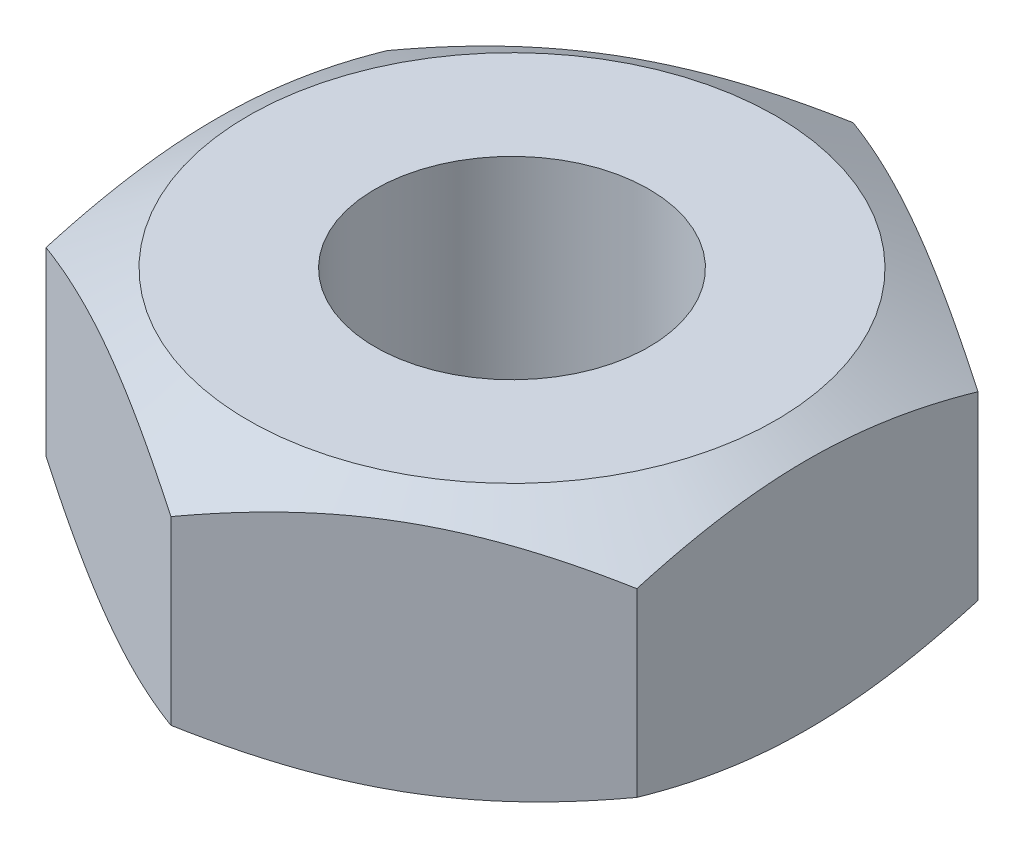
ISO-10303-21;
HEADER;
FILE_DESCRIPTION(('STEP AP214'),'2;1');
FILE_NAME('part.step','',(''),(''),'','','');
FILE_SCHEMA(('AUTOMOTIVE_DESIGN { 1 0 10303 214 1 1 1 1 }'));
ENDSEC;
DATA;
#1=APPLICATION_CONTEXT('core data for automotive mechanical design processes');
#2=APPLICATION_PROTOCOL_DEFINITION('international standard','automotive_design',2000,#1);
#3=PRODUCT_CONTEXT('',#1,'mechanical');
#4=PRODUCT('Part','Part','',(#3));
#5=PRODUCT_RELATED_PRODUCT_CATEGORY('part','',(#4));
#6=PRODUCT_DEFINITION_FORMATION('','',#4);
#7=PRODUCT_DEFINITION_CONTEXT('part definition',#1,'design');
#8=PRODUCT_DEFINITION('design','',#6,#7);
#9=PRODUCT_DEFINITION_SHAPE('','',#8);
#10=(LENGTH_UNIT() NAMED_UNIT(*) SI_UNIT(.MILLI.,.METRE.));
#11=(NAMED_UNIT(*) PLANE_ANGLE_UNIT() SI_UNIT($,.RADIAN.));
#12=(NAMED_UNIT(*) SI_UNIT($,.STERADIAN.) SOLID_ANGLE_UNIT());
#13=UNCERTAINTY_MEASURE_WITH_UNIT(LENGTH_MEASURE(1.E-05),#10,'distance_accuracy_value','');
#14=(GEOMETRIC_REPRESENTATION_CONTEXT(3) GLOBAL_UNCERTAINTY_ASSIGNED_CONTEXT((#13)) GLOBAL_UNIT_ASSIGNED_CONTEXT((#10,
#11,#12)) REPRESENTATION_CONTEXT('',''));
#15=CARTESIAN_POINT('',(0.,0.,0.));
#16=DIRECTION('',(0.,0.,1.));
#17=DIRECTION('',(1.,0.,0.));
#18=AXIS2_PLACEMENT_3D('',#15,#16,#17);
#19=CARTESIAN_POINT('',(0.,0.532288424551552,0.));
#20=DIRECTION('',(0.,1.,0.));
#21=DIRECTION('',(0.,0.,1.));
#22=AXIS2_PLACEMENT_3D('',#19,#20,#21);
#23=CONICAL_SURFACE('',#22,4.0469505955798,1.04719755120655);
#24=CARTESIAN_POINT('',(-3.49999999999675,0.529113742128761,-2.02072594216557));
#25=CARTESIAN_POINT('',(-3.34619619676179,0.477830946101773,-2.10952460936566));
#26=CARTESIAN_POINT('',(-3.19106476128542,0.431191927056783,-2.19908978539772));
#27=CARTESIAN_POINT('',(-2.87811589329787,0.3497849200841,-2.37977089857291));
#28=CARTESIAN_POINT('',(-2.72029290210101,0.315045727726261,-2.47089004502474));
#29=CARTESIAN_POINT('',(-2.40660274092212,0.260971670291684,-2.65199914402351));
#30=CARTESIAN_POINT('',(-2.25078382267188,0.241276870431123,-2.74196123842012));
#31=CARTESIAN_POINT('',(-1.93841318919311,0.217769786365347,-2.92230850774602));
#32=CARTESIAN_POINT('',(-1.78186260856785,0.21393803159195,-3.0126930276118));
#33=CARTESIAN_POINT('',(-1.48936464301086,0.221929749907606,-3.18156680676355));
#34=CARTESIAN_POINT('',(-1.35337336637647,0.231790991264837,-3.26008140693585));
#35=CARTESIAN_POINT('',(-1.08227675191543,0.263039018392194,-3.41659911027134));
#36=CARTESIAN_POINT('',(-0.947172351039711,0.284436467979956,-3.49460167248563));
#37=CARTESIAN_POINT('',(-0.675517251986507,0.337925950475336,-3.65144181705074));
#38=CARTESIAN_POINT('',(-0.539000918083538,0.370244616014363,-3.7302595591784));
#39=CARTESIAN_POINT('',(-0.268003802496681,0.443594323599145,-3.88671981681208));
#40=CARTESIAN_POINT('',(-0.133519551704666,0.484608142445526,-3.96436433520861));
#41=CARTESIAN_POINT('',(-5.59434357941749E-12,0.52911374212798,-4.04145188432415));
#42=B_SPLINE_CURVE_WITH_KNOTS('',3,(#24,#25,#26,#27,#28,#29,#30,#31,#32,#33,#34,#35,#36,#37,#38,
#39,#40,#41),.UNSPECIFIED.,.F.,.F.,(4,2,2,2,2,2,2,2,4),(0.,0.554778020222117,1.1108891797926,
1.65323831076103,2.19492155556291,2.66648861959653,3.1384923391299,3.62096283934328,
4.10248645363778),.UNSPECIFIED.);
#43=CARTESIAN_POINT('',(-3.49999999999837,0.529113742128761,-2.02072594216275));
#44=VERTEX_POINT('',#43);
#45=CARTESIAN_POINT('',(0.,0.529113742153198,-4.04145188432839));
#46=VERTEX_POINT('',#45);
#47=EDGE_CURVE('E65',#44,#46,#42,.T.);
#48=ORIENTED_EDGE('',*,*,#47,.T.);
#49=CARTESIAN_POINT('',(5.5952416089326E-12,0.52911374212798,-4.04145188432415));
#50=CARTESIAN_POINT('',(0.153803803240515,0.477830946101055,-3.95265321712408));
#51=CARTESIAN_POINT('',(0.308935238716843,0.431191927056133,-3.86308804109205));
#52=CARTESIAN_POINT('',(0.621884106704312,0.349784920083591,-3.6824069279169));
#53=CARTESIAN_POINT('',(0.779707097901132,0.315045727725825,-3.5912877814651));
#54=CARTESIAN_POINT('',(1.09339725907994,0.260971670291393,-3.41017868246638));
#55=CARTESIAN_POINT('',(1.24921617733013,0.241276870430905,-3.32021658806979));
#56=CARTESIAN_POINT('',(1.56158681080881,0.217769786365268,-3.13986931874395));
#57=CARTESIAN_POINT('',(1.71813739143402,0.213938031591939,-3.04948479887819));
#58=CARTESIAN_POINT('',(2.01063535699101,0.221929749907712,-2.88061101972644));
#59=CARTESIAN_POINT('',(2.14662663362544,0.231790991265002,-2.80209641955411));
#60=CARTESIAN_POINT('',(2.41772324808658,0.26303901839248,-2.64557871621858));
#61=CARTESIAN_POINT('',(2.55282764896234,0.284436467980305,-2.56757615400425));
#62=CARTESIAN_POINT('',(2.82448274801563,0.337925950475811,-2.4107360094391));
#63=CARTESIAN_POINT('',(2.96099908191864,0.370244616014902,-2.33191826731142));
#64=CARTESIAN_POINT('',(3.23199619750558,0.443594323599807,-2.17545800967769));
#65=CARTESIAN_POINT('',(3.36648044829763,0.484608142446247,-2.09781349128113));
#66=CARTESIAN_POINT('',(3.49999999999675,0.529113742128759,-2.02072594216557));
#67=B_SPLINE_CURVE_WITH_KNOTS('',3,(#49,#50,#51,#52,#53,#54,#55,#56,#57,#58,#59,#60,#61,#62,#63,
#64,#65,#66),.UNSPECIFIED.,.F.,.F.,(4,2,2,2,2,2,2,2,4),(0.,0.554778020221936,1.11088917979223,
1.6532383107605,2.19492155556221,2.666488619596,3.13849233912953,3.6209628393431,
4.10248645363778),.UNSPECIFIED.);
#68=CARTESIAN_POINT('',(3.49999999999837,0.529113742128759,-2.02072594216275));
#69=VERTEX_POINT('',#68);
#70=EDGE_CURVE('E199',#46,#69,#67,.T.);
#71=ORIENTED_EDGE('',*,*,#70,.T.);
#72=CARTESIAN_POINT('',(3.5,0.529113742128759,-2.02072594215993));
#73=CARTESIAN_POINT('',(3.5,0.477830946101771,-1.84312860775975));
#74=CARTESIAN_POINT('',(3.5,0.431191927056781,-1.66399825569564));
#75=CARTESIAN_POINT('',(3.5,0.349784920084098,-1.30263602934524));
#76=CARTESIAN_POINT('',(3.5,0.315045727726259,-1.1203977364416));
#77=CARTESIAN_POINT('',(3.5,0.260971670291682,-0.758179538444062));
#78=CARTESIAN_POINT('',(3.5,0.241276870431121,-0.578255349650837));
#79=CARTESIAN_POINT('',(3.5,0.217769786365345,-0.217560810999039));
#80=CARTESIAN_POINT('',(3.5,0.213938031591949,-0.0367917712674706));
#81=CARTESIAN_POINT('',(3.5,0.221929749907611,0.300955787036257));
#82=CARTESIAN_POINT('',(3.5,0.231790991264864,0.457984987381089));
#83=CARTESIAN_POINT('',(3.5,0.2630390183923,0.771020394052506));
#84=CARTESIAN_POINT('',(3.5,0.284436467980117,0.927025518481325));
#85=CARTESIAN_POINT('',(3.5,0.337925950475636,1.24070580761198));
#86=CARTESIAN_POINT('',(3.5,0.370244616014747,1.39834129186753));
#87=CARTESIAN_POINT('',(3.5,0.443594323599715,1.71126180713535));
#88=CARTESIAN_POINT('',(3.5,0.484608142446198,1.86655084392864));
#89=CARTESIAN_POINT('',(3.5,0.52911374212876,2.02072594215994));
#90=B_SPLINE_CURVE_WITH_KNOTS('',3,(#72,#73,#74,#75,#76,#77,#78,#79,#80,#81,#82,#83,#84,#85,#86,
#87,#88,#89),.UNSPECIFIED.,.F.,.F.,(4,2,2,2,2,2,2,2,4),(0.,0.554778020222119,1.1108891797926,
1.65323831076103,2.19492155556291,2.66648861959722,3.13849233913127,3.62096283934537,
4.10248645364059),.UNSPECIFIED.);
#91=CARTESIAN_POINT('',(3.49999999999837,0.52911374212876,2.02072594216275));
#92=VERTEX_POINT('',#91);
#93=EDGE_CURVE('E160',#69,#92,#90,.T.);
#94=ORIENTED_EDGE('',*,*,#93,.T.);
#95=CARTESIAN_POINT('',(3.49999999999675,0.529113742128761,2.02072594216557));
#96=CARTESIAN_POINT('',(3.34619619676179,0.477830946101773,2.10952460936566));
#97=CARTESIAN_POINT('',(3.19106476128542,0.431191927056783,2.19908978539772));
#98=CARTESIAN_POINT('',(2.87811589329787,0.3497849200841,2.37977089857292));
#99=CARTESIAN_POINT('',(2.72029290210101,0.315045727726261,2.47089004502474));
#100=CARTESIAN_POINT('',(2.40660274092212,0.260971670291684,2.65199914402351));
#101=CARTESIAN_POINT('',(2.25078382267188,0.241276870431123,2.74196123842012));
#102=CARTESIAN_POINT('',(1.93841318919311,0.217769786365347,2.92230850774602));
#103=CARTESIAN_POINT('',(1.78186260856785,0.213938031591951,3.0126930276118));
#104=CARTESIAN_POINT('',(1.48936464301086,0.221929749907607,3.18156680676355));
#105=CARTESIAN_POINT('',(1.35337336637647,0.231790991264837,3.26008140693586));
#106=CARTESIAN_POINT('',(1.08227675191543,0.263039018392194,3.41659911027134));
#107=CARTESIAN_POINT('',(0.947172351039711,0.284436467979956,3.49460167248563));
#108=CARTESIAN_POINT('',(0.675517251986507,0.337925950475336,3.65144181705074));
#109=CARTESIAN_POINT('',(0.539000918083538,0.370244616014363,3.7302595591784));
#110=CARTESIAN_POINT('',(0.268003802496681,0.443594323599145,3.88671981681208));
#111=CARTESIAN_POINT('',(0.133519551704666,0.484608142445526,3.96436433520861));
#112=CARTESIAN_POINT('',(5.5942902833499E-12,0.52911374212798,4.04145188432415));
#113=B_SPLINE_CURVE_WITH_KNOTS('',3,(#95,#96,#97,#98,#99,#100,#101,#102,#103,#104,#105,#106,
#107,#108,#109,#110,#111,#112),.UNSPECIFIED.,.F.,.F.,(4,2,2,2,2,2,2,2,4),(0.,0.554778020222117,
1.1108891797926,1.65323831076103,2.19492155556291,2.66648861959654,3.1384923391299,
3.62096283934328,4.10248645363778),.UNSPECIFIED.);
#114=CARTESIAN_POINT('',(0.,0.529113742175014,4.04145188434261));
#115=VERTEX_POINT('',#114);
#116=EDGE_CURVE('E154',#92,#115,#113,.T.);
#117=ORIENTED_EDGE('',*,*,#116,.T.);
#118=CARTESIAN_POINT('',(-5.5952630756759E-12,0.52911374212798,4.04145188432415));
#119=CARTESIAN_POINT('',(-0.153803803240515,0.477830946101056,3.95265321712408));
#120=CARTESIAN_POINT('',(-0.308935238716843,0.431191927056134,3.86308804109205));
#121=CARTESIAN_POINT('',(-0.621884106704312,0.349784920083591,3.6824069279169));
#122=CARTESIAN_POINT('',(-0.779707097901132,0.315045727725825,3.5912877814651));
#123=CARTESIAN_POINT('',(-1.09339725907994,0.260971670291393,3.41017868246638));
#124=CARTESIAN_POINT('',(-1.24921617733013,0.241276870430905,3.32021658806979));
#125=CARTESIAN_POINT('',(-1.56158681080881,0.217769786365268,3.13986931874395));
#126=CARTESIAN_POINT('',(-1.71813739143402,0.213938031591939,3.04948479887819));
#127=CARTESIAN_POINT('',(-2.01063535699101,0.221929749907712,2.88061101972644));
#128=CARTESIAN_POINT('',(-2.14662663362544,0.231790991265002,2.80209641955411));
#129=CARTESIAN_POINT('',(-2.41772324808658,0.263039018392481,2.64557871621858));
#130=CARTESIAN_POINT('',(-2.55282764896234,0.284436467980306,2.56757615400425));
#131=CARTESIAN_POINT('',(-2.82448274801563,0.337925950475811,2.4107360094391));
#132=CARTESIAN_POINT('',(-2.96099908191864,0.370244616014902,2.33191826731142));
#133=CARTESIAN_POINT('',(-3.23199619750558,0.443594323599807,2.17545800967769));
#134=CARTESIAN_POINT('',(-3.36648044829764,0.484608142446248,2.09781349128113));
#135=CARTESIAN_POINT('',(-3.49999999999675,0.52911374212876,2.02072594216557));
#136=B_SPLINE_CURVE_WITH_KNOTS('',3,(#118,#119,#120,#121,#122,#123,#124,#125,#126,#127,#128,
#129,#130,#131,#132,#133,#134,#135),.UNSPECIFIED.,.F.,.F.,(4,2,2,2,2,2,2,2,4),(0.,
0.554778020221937,1.11088917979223,1.6532383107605,2.19492155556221,2.666488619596,
3.13849233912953,3.6209628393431,4.10248645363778),.UNSPECIFIED.);
#137=CARTESIAN_POINT('',(-3.49999999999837,0.52911374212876,2.02072594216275));
#138=VERTEX_POINT('',#137);
#139=EDGE_CURVE('E67',#115,#138,#136,.T.);
#140=ORIENTED_EDGE('',*,*,#139,.T.);
#141=CARTESIAN_POINT('',(-3.5,0.52911374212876,2.02072594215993));
#142=CARTESIAN_POINT('',(-3.5,0.477830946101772,1.84312860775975));
#143=CARTESIAN_POINT('',(-3.5,0.431191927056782,1.66399825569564));
#144=CARTESIAN_POINT('',(-3.5,0.349784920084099,1.30263602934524));
#145=CARTESIAN_POINT('',(-3.5,0.315045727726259,1.1203977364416));
#146=CARTESIAN_POINT('',(-3.5,0.260971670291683,0.75817953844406));
#147=CARTESIAN_POINT('',(-3.5,0.241276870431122,0.578255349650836));
#148=CARTESIAN_POINT('',(-3.5,0.217769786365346,0.217560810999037));
#149=CARTESIAN_POINT('',(-3.5,0.21393803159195,0.0367917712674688));
#150=CARTESIAN_POINT('',(-3.5,0.221929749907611,-0.300955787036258));
#151=CARTESIAN_POINT('',(-3.5,0.231790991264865,-0.457984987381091));
#152=CARTESIAN_POINT('',(-3.5,0.2630390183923,-0.771020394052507));
#153=CARTESIAN_POINT('',(-3.5,0.284436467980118,-0.927025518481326));
#154=CARTESIAN_POINT('',(-3.5,0.337925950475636,-1.24070580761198));
#155=CARTESIAN_POINT('',(-3.5,0.370244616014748,-1.39834129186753));
#156=CARTESIAN_POINT('',(-3.5,0.443594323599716,-1.71126180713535));
#157=CARTESIAN_POINT('',(-3.5,0.484608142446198,-1.86655084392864));
#158=CARTESIAN_POINT('',(-3.5,0.52911374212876,-2.02072594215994));
#159=B_SPLINE_CURVE_WITH_KNOTS('',3,(#141,#142,#143,#144,#145,#146,#147,#148,#149,#150,#151,
#152,#153,#154,#155,#156,#157,#158),.UNSPECIFIED.,.F.,.F.,(4,2,2,2,2,2,2,2,4),(0.,
0.554778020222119,1.1108891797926,1.65323831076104,2.19492155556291,2.66648861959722,
3.13849233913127,3.62096283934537,4.10248645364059),.UNSPECIFIED.);
#160=EDGE_CURVE('E62',#138,#44,#159,.T.);
#161=ORIENTED_EDGE('',*,*,#160,.T.);
#162=EDGE_LOOP('',(#48,#71,#94,#117,#140,#161));
#163=FACE_BOUND('',#162,.T.);
#164=CARTESIAN_POINT('',(0.,0.,0.));
#165=DIRECTION('',(0.,1.,0.));
#166=DIRECTION('',(0.,0.,1.));
#167=AXIS2_PLACEMENT_3D('',#164,#165,#166);
#168=CIRCLE('',#167,3.12499999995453);
#169=CARTESIAN_POINT('',(0.,0.,3.12499999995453));
#170=VERTEX_POINT('',#169);
#171=EDGE_CURVE('E20',#170,#170,#168,.T.);
#172=ORIENTED_EDGE('',*,*,#171,.T.);
#173=EDGE_LOOP('',(#172));
#174=FACE_BOUND('',#173,.T.);
#175=ADVANCED_FACE('F16',(#163,#174),#23,.T.);
#176=CARTESIAN_POINT('',(0.,0.,0.));
#177=DIRECTION('',(0.,1.,0.));
#178=DIRECTION('',(0.,0.,1.));
#179=AXIS2_PLACEMENT_3D('',#176,#177,#178);
#180=PLANE('',#179);
#181=ORIENTED_EDGE('',*,*,#171,.F.);
#182=EDGE_LOOP('',(#181));
#183=FACE_BOUND('',#182,.T.);
#184=CARTESIAN_POINT('',(0.,-5.6843418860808E-11,0.));
#185=DIRECTION('',(0.,-1.,0.));
#186=DIRECTION('',(0.,0.,-1.));
#187=AXIS2_PLACEMENT_3D('',#184,#185,#186);
#188=CIRCLE('',#187,1.83981575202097);
#189=CARTESIAN_POINT('',(0.,-5.6843418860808E-11,-1.83981575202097));
#190=VERTEX_POINT('',#189);
#191=EDGE_CURVE('E225',#190,#190,#188,.F.);
#192=ORIENTED_EDGE('',*,*,#191,.T.);
#193=EDGE_LOOP('',(#192));
#194=FACE_BOUND('',#193,.T.);
#195=ADVANCED_FACE('F230',(#183,#194),#180,.F.);
#196=CARTESIAN_POINT('',(0.,3.2,-4.04145188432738));
#197=DIRECTION('',(0.5,0.,0.866025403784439));
#198=DIRECTION('',(0.866025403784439,0.,-0.5));
#199=AXIS2_PLACEMENT_3D('',#196,#197,#198);
#200=PLANE('',#199);
#201=ORIENTED_EDGE('',*,*,#47,.F.);
#202=DIRECTION('',(0.,1.,0.));
#203=VECTOR('',#202,1.);
#204=CARTESIAN_POINT('',(-3.5,3.2,-2.02072594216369));
#205=LINE('',#204,#203);
#206=CARTESIAN_POINT('',(-3.5,2.67088625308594,-2.02072595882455));
#207=VERTEX_POINT('',#206);
#208=EDGE_CURVE('E72',#44,#207,#205,.T.);
#209=ORIENTED_EDGE('',*,*,#208,.T.);
#210=CARTESIAN_POINT('',(7.14526385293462E-12,2.67088625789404,-4.04145188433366));
#211=CARTESIAN_POINT('',(-0.153803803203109,2.72216905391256,-3.95265321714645));
#212=CARTESIAN_POINT('',(-0.308935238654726,2.76880807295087,-3.86308804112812));
#213=CARTESIAN_POINT('',(-0.621884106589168,2.85021507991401,-3.68240692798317));
#214=CARTESIAN_POINT('',(-0.779707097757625,2.88495427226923,-3.5912877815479));
#215=CARTESIAN_POINT('',(-1.0933972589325,2.93902832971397,-3.41017868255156));
#216=CARTESIAN_POINT('',(-1.24921617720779,2.95872312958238,-3.32021658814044));
#217=CARTESIAN_POINT('',(-1.56158681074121,2.98223021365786,-3.13986931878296));
#218=CARTESIAN_POINT('',(-1.71813739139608,2.98606196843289,-3.04948479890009));
#219=CARTESIAN_POINT('',(-2.01063535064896,2.9780702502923,-2.88061102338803));
#220=CARTESIAN_POINT('',(-2.1466266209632,2.96820900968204,-2.80209642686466));
#221=CARTESIAN_POINT('',(-2.41772322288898,2.93696098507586,-2.64557873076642));
#222=CARTESIAN_POINT('',(-2.55282761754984,2.91556353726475,-2.56757617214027));
#223=CARTESIAN_POINT('',(-2.82448270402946,2.86207405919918,-2.41073603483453));
#224=CARTESIAN_POINT('',(-2.96099903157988,2.8297553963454,-2.33191829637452));
#225=CARTESIAN_POINT('',(-3.23199613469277,2.75640569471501,-2.17545804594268));
#226=CARTESIAN_POINT('',(-3.36648037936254,2.71539187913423,-2.09781353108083));
#227=CARTESIAN_POINT('',(-3.49999992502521,2.67088628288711,-2.02072598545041));
#228=B_SPLINE_CURVE_WITH_KNOTS('',3,(#210,#211,#212,#213,#214,#215,#216,#217,#218,#219,#220,
#221,#222,#223,#224,#225,#226,#227),.UNSPECIFIED.,.F.,.F.,(4,2,2,2,2,2,2,2,4),(0.,
0.554778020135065,1.1108891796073,1.65323831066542,2.19492155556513,2.666488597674,
3.13849229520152,3.62096277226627,4.10248636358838),.UNSPECIFIED.);
#229=CARTESIAN_POINT('',(0.,2.67088625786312,-4.04145188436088));
#230=VERTEX_POINT('',#229);
#231=EDGE_CURVE('E35',#230,#207,#228,.T.);
#232=ORIENTED_EDGE('',*,*,#231,.F.);
#233=DIRECTION('',(0.,1.,0.));
#234=VECTOR('',#233,1.);
#235=CARTESIAN_POINT('',(0.,3.2,-4.04145188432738));
#236=LINE('',#235,#234);
#237=EDGE_CURVE('E76',#230,#46,#236,.F.);
#238=ORIENTED_EDGE('',*,*,#237,.T.);
#239=EDGE_LOOP('',(#201,#209,#232,#238));
#240=FACE_BOUND('',#239,.T.);
#241=ADVANCED_FACE('F74',(#240),#200,.F.);
#242=CARTESIAN_POINT('',(-3.5,3.2,-2.02072594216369));
#243=DIRECTION('',(1.,0.,0.));
#244=DIRECTION('',(0.,0.,-1.));
#245=AXIS2_PLACEMENT_3D('',#242,#243,#244);
#246=PLANE('',#245);
#247=ORIENTED_EDGE('',*,*,#160,.F.);
#248=DIRECTION('',(0.,1.,0.));
#249=VECTOR('',#248,1.);
#250=CARTESIAN_POINT('',(-3.5,3.2,2.02072594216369));
#251=LINE('',#250,#249);
#252=CARTESIAN_POINT('',(-3.50000001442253,2.67088625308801,2.02072593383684));
#253=VERTEX_POINT('',#252);
#254=EDGE_CURVE('E82',#138,#253,#251,.T.);
#255=ORIENTED_EDGE('',*,*,#254,.T.);
#256=CARTESIAN_POINT('',(-3.5,2.67088624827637,-2.0207259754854));
#257=CARTESIAN_POINT('',(-3.5,2.72216904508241,-1.84312864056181));
#258=CARTESIAN_POINT('',(-3.5,2.76880806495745,-1.66399828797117));
#259=CARTESIAN_POINT('',(-3.5,2.85021507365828,-1.30263606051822));
#260=CARTESIAN_POINT('',(-3.5,2.88495426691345,-1.12039776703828));
#261=CARTESIAN_POINT('',(-3.5,2.93902832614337,-0.75817956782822));
#262=CARTESIAN_POINT('',(-3.5,2.95872312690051,-0.578255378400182));
#263=CARTESIAN_POINT('',(-3.5,2.98223021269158,-0.217560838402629));
#264=CARTESIAN_POINT('',(-3.5,2.98606196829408,-0.0367917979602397));
#265=CARTESIAN_POINT('',(-3.5,2.97807025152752,0.300955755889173));
#266=CARTESIAN_POINT('',(-3.5,2.96820901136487,0.457984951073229));
#267=CARTESIAN_POINT('',(-3.5,2.9369609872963,0.771020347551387));
#268=CARTESIAN_POINT('',(-3.5,2.9155635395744,0.927025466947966));
#269=CARTESIAN_POINT('',(-3.5,2.86207406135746,1.24070574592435));
#270=CARTESIAN_POINT('',(-3.5,2.82975539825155,1.39834122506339));
#271=CARTESIAN_POINT('',(-3.5,2.75640569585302,1.71126173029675));
#272=CARTESIAN_POINT('',(-3.5,2.71539187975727,1.86655076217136));
#273=CARTESIAN_POINT('',(-3.5,2.67088628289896,2.02072585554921));
#274=B_SPLINE_CURVE_WITH_KNOTS('',3,(#256,#257,#258,#259,#260,#261,#262,#263,#264,#265,#266,
#267,#268,#269,#270,#271,#272,#273),.UNSPECIFIED.,.F.,.F.,(4,2,2,2,2,2,2,2,4),(0.,
0.554778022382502,1.11088918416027,1.65323831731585,2.19492156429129,2.66648861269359,
3.13849231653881,3.62096280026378,4.1024863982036),.UNSPECIFIED.);
#275=EDGE_CURVE('E80',#207,#253,#274,.T.);
#276=ORIENTED_EDGE('',*,*,#275,.F.);
#277=ORIENTED_EDGE('',*,*,#208,.F.);
#278=EDGE_LOOP('',(#247,#255,#276,#277));
#279=FACE_BOUND('',#278,.T.);
#280=ADVANCED_FACE('F78',(#279),#246,.F.);
#281=CARTESIAN_POINT('',(-3.5,3.2,2.02072594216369));
#282=DIRECTION('',(0.5,0.,-0.866025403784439));
#283=DIRECTION('',(-0.866025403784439,0.,-0.5));
#284=AXIS2_PLACEMENT_3D('',#281,#282,#283);
#285=PLANE('',#284);
#286=ORIENTED_EDGE('',*,*,#139,.F.);
#287=DIRECTION('',(0.,1.,0.));
#288=VECTOR('',#287,1.);
#289=CARTESIAN_POINT('',(0.,3.2,4.04145188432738));
#290=LINE('',#289,#288);
#291=CARTESIAN_POINT('',(0.,2.67088625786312,4.04145188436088));
#292=VERTEX_POINT('',#291);
#293=EDGE_CURVE('E159',#115,#292,#290,.T.);
#294=ORIENTED_EDGE('',*,*,#293,.T.);
#295=CARTESIAN_POINT('',(-3.50000002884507,2.67088624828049,2.02072592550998));
#296=CARTESIAN_POINT('',(-3.34619622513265,2.72216904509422,2.10952459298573));
#297=CARTESIAN_POINT('',(-3.19106478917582,2.76880806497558,2.19908976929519));
#298=CARTESIAN_POINT('',(-2.87811592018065,2.85021507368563,2.37977088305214));
#299=CARTESIAN_POINT('',(-2.72029292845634,2.88495426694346,2.47089002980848));
#300=CARTESIAN_POINT('',(-2.40660276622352,2.93902832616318,2.65199912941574));
#301=CARTESIAN_POINT('',(-2.25078384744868,2.95872312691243,2.74196122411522));
#302=CARTESIAN_POINT('',(-1.93841321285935,2.98223021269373,2.92230849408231));
#303=CARTESIAN_POINT('',(-1.78186263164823,2.9860619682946,3.01269301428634));
#304=CARTESIAN_POINT('',(-1.48936466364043,2.97807025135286,3.18156679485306));
#305=CARTESIAN_POINT('',(-1.35337338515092,2.96820901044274,3.26008139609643));
#306=CARTESIAN_POINT('',(-1.08227676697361,2.93696098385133,3.41659910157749));
#307=CARTESIAN_POINT('',(-0.947172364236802,2.91556353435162,3.49460166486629));
#308=CARTESIAN_POINT('',(-0.675517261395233,2.86207405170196,3.65144181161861));
#309=CARTESIAN_POINT('',(-0.53900092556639,2.82975538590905,3.73025955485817));
#310=CARTESIAN_POINT('',(-0.268003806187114,2.75640567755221,3.88671981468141));
#311=CARTESIAN_POINT('',(-0.133519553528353,2.71539185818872,3.96436433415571));
#312=CARTESIAN_POINT('',(8.05303092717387E-12,2.67088625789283,4.04145188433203));
#313=B_SPLINE_CURVE_WITH_KNOTS('',3,(#295,#296,#297,#298,#299,#300,#301,#302,#303,#304,#305,
#306,#307,#308,#309,#310,#311,#312),.UNSPECIFIED.,.F.,.F.,(4,2,2,2,2,2,2,2,4),(0.,
0.554778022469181,1.11088918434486,1.65323831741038,2.19492156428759,2.66648863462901,
3.13849236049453,3.6209628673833,4.10248648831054),.UNSPECIFIED.);
#314=EDGE_CURVE('E120',#253,#292,#313,.T.);
#315=ORIENTED_EDGE('',*,*,#314,.F.);
#316=ORIENTED_EDGE('',*,*,#254,.F.);
#317=EDGE_LOOP('',(#286,#294,#315,#316));
#318=FACE_BOUND('',#317,.T.);
#319=ADVANCED_FACE('F139',(#318),#285,.F.);
#320=CARTESIAN_POINT('',(0.,3.2,4.04145188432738));
#321=DIRECTION('',(-0.5,0.,-0.866025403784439));
#322=DIRECTION('',(-0.866025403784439,0.,0.5));
#323=AXIS2_PLACEMENT_3D('',#320,#321,#322);
#324=PLANE('',#323);
#325=ORIENTED_EDGE('',*,*,#116,.F.);
#326=DIRECTION('',(0.,1.,0.));
#327=VECTOR('',#326,1.);
#328=CARTESIAN_POINT('',(3.5,3.2,2.02072594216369));
#329=LINE('',#328,#327);
#330=CARTESIAN_POINT('',(3.5,2.67088625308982,2.02072595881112));
#331=VERTEX_POINT('',#330);
#332=EDGE_CURVE('E189',#92,#331,#329,.T.);
#333=ORIENTED_EDGE('',*,*,#332,.T.);
#334=CARTESIAN_POINT('',(-7.14492545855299E-12,2.67088625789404,4.04145188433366));
#335=CARTESIAN_POINT('',(0.153803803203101,2.72216905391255,3.95265321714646));
#336=CARTESIAN_POINT('',(0.30893523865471,2.76880807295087,3.86308804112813));
#337=CARTESIAN_POINT('',(0.621884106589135,2.850215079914,3.68240692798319));
#338=CARTESIAN_POINT('',(0.779707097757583,2.88495427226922,3.59128778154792));
#339=CARTESIAN_POINT('',(1.09339725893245,2.93902832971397,3.41017868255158));
#340=CARTESIAN_POINT('',(1.24921617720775,2.95872312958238,3.32021658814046));
#341=CARTESIAN_POINT('',(1.56158681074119,2.98223021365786,3.13986931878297));
#342=CARTESIAN_POINT('',(1.71813739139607,2.98606196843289,3.04948479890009));
#343=CARTESIAN_POINT('',(2.01063535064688,2.97807025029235,2.88061102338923));
#344=CARTESIAN_POINT('',(2.14662662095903,2.96820900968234,2.80209642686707));
#345=CARTESIAN_POINT('',(2.41772322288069,2.936960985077,2.6455787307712));
#346=CARTESIAN_POINT('',(2.5528276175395,2.91556353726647,2.56757617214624));
#347=CARTESIAN_POINT('',(2.82448270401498,2.86207405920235,2.41073603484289));
#348=CARTESIAN_POINT('',(2.96099903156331,2.82975539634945,2.33191829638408));
#349=CARTESIAN_POINT('',(3.2319961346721,2.75640569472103,2.17545804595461));
#350=CARTESIAN_POINT('',(3.36648037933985,2.71539187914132,2.09781353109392));
#351=CARTESIAN_POINT('',(3.49999992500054,2.67088628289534,2.02072598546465));
#352=B_SPLINE_CURVE_WITH_KNOTS('',3,(#334,#335,#336,#337,#338,#339,#340,#341,#342,#343,#344,
#345,#346,#347,#348,#349,#350,#351),.UNSPECIFIED.,.F.,.F.,(4,2,2,2,2,2,2,2,4),(0.,
0.554778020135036,1.11088917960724,1.65323831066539,2.19492155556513,2.66648859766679,
3.13849229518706,3.62096277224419,4.10248636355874),.UNSPECIFIED.);
#353=EDGE_CURVE('E172',#292,#331,#352,.T.);
#354=ORIENTED_EDGE('',*,*,#353,.F.);
#355=ORIENTED_EDGE('',*,*,#293,.F.);
#356=EDGE_LOOP('',(#325,#333,#354,#355));
#357=FACE_BOUND('',#356,.T.);
#358=ADVANCED_FACE('F165',(#357),#324,.F.);
#359=CARTESIAN_POINT('',(3.5,3.2,2.02072594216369));
#360=DIRECTION('',(-1.,0.,0.));
#361=DIRECTION('',(0.,0.,1.));
#362=AXIS2_PLACEMENT_3D('',#359,#360,#361);
#363=PLANE('',#362);
#364=ORIENTED_EDGE('',*,*,#93,.F.);
#365=DIRECTION('',(0.,1.,0.));
#366=VECTOR('',#365,1.);
#367=CARTESIAN_POINT('',(3.5,3.2,-2.02072594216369));
#368=LINE('',#367,#366);
#369=CARTESIAN_POINT('',(3.50000001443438,2.67088625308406,-2.02072593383));
#370=VERTEX_POINT('',#369);
#371=EDGE_CURVE('E196',#69,#370,#368,.T.);
#372=ORIENTED_EDGE('',*,*,#371,.T.);
#373=CARTESIAN_POINT('',(3.5,2.67088624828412,2.02072597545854));
#374=CARTESIAN_POINT('',(3.5,2.72216904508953,1.84312864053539));
#375=CARTESIAN_POINT('',(3.5,2.7688080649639,1.66399828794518));
#376=CARTESIAN_POINT('',(3.5,2.85021507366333,1.30263606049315));
#377=CARTESIAN_POINT('',(3.5,2.88495426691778,1.1203977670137));
#378=CARTESIAN_POINT('',(3.5,2.93902832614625,0.758179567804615));
#379=CARTESIAN_POINT('',(3.5,2.95872312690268,0.578255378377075));
#380=CARTESIAN_POINT('',(3.5,2.98223021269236,0.217560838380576));
#381=CARTESIAN_POINT('',(3.5,2.9860619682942,0.0367917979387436));
#382=CARTESIAN_POINT('',(3.5,2.97807025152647,-0.300955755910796));
#383=CARTESIAN_POINT('',(3.5,2.96820901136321,-0.45798495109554));
#384=CARTESIAN_POINT('',(3.5,2.93696098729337,-0.771020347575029));
#385=CARTESIAN_POINT('',(3.5,2.91556353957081,-0.927025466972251));
#386=CARTESIAN_POINT('',(3.5,2.86207406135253,-1.24070574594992));
#387=CARTESIAN_POINT('',(3.5,2.82975539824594,-1.39834122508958));
#388=CARTESIAN_POINT('',(3.5,2.75640569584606,-1.71126173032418));
#389=CARTESIAN_POINT('',(3.5,2.71539187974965,-1.86655076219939));
#390=CARTESIAN_POINT('',(3.5,2.6708862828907,-2.02072585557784));
#391=B_SPLINE_CURVE_WITH_KNOTS('',3,(#373,#374,#375,#376,#377,#378,#379,#380,#381,#382,#383,
#384,#385,#386,#387,#388,#389,#390),.UNSPECIFIED.,.F.,.F.,(4,2,2,2,2,2,2,2,4),(0.,
0.554778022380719,1.11088918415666,1.65323831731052,2.19492156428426,2.66648861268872,
3.13849231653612,3.62096280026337,4.10248639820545),.UNSPECIFIED.);
#392=EDGE_CURVE('E98',#331,#370,#391,.T.);
#393=ORIENTED_EDGE('',*,*,#392,.F.);
#394=ORIENTED_EDGE('',*,*,#332,.F.);
#395=EDGE_LOOP('',(#364,#372,#393,#394));
#396=FACE_BOUND('',#395,.T.);
#397=ADVANCED_FACE('F168',(#396),#363,.F.);
#398=CARTESIAN_POINT('',(3.5,3.2,-2.02072594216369));
#399=DIRECTION('',(-0.5,0.,0.866025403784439));
#400=DIRECTION('',(0.866025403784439,0.,0.5));
#401=AXIS2_PLACEMENT_3D('',#398,#399,#400);
#402=PLANE('',#401);
#403=ORIENTED_EDGE('',*,*,#70,.F.);
#404=ORIENTED_EDGE('',*,*,#237,.F.);
#405=CARTESIAN_POINT('',(3.50000002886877,2.67088624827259,-2.0207259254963));
#406=CARTESIAN_POINT('',(3.34619622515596,2.72216904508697,-2.10952459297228));
#407=CARTESIAN_POINT('',(3.19106478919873,2.76880806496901,-2.19908976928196));
#408=CARTESIAN_POINT('',(2.87811592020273,2.85021507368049,-2.37977088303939));
#409=CARTESIAN_POINT('',(2.72029292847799,2.88495426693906,-2.47089002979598));
#410=CARTESIAN_POINT('',(2.4066027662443,2.93902832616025,-2.65199912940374));
#411=CARTESIAN_POINT('',(2.25078384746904,2.95872312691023,-2.74196122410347));
#412=CARTESIAN_POINT('',(1.93841321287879,2.98223021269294,-2.92230849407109));
#413=CARTESIAN_POINT('',(1.78186263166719,2.98606196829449,-3.01269301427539));
#414=CARTESIAN_POINT('',(1.48936466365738,2.97807025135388,-3.18156679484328));
#415=CARTESIAN_POINT('',(1.35337338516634,2.96820901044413,-3.26008139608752));
#416=CARTESIAN_POINT('',(1.08227676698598,2.93696098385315,-3.41659910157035));
#417=CARTESIAN_POINT('',(0.947172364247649,2.91556353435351,-3.49460166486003));
#418=CARTESIAN_POINT('',(0.675517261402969,2.86207405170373,-3.65144181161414));
#419=CARTESIAN_POINT('',(0.539000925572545,2.82975538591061,-3.73025955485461));
#420=CARTESIAN_POINT('',(0.268003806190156,2.75640567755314,-3.88671981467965));
#421=CARTESIAN_POINT('',(0.133519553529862,2.71539185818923,-3.96436433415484));
#422=CARTESIAN_POINT('',(-8.05245337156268E-12,2.67088625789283,-4.04145188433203));
#423=B_SPLINE_CURVE_WITH_KNOTS('',3,(#405,#406,#407,#408,#409,#410,#411,#412,#413,#414,#415,
#416,#417,#418,#419,#420,#421,#422),.UNSPECIFIED.,.F.,.F.,(4,2,2,2,2,2,2,2,4),(0.,
0.554778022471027,1.1108891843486,1.65323831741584,2.19492156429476,2.66648863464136,
3.13849236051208,3.62096286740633,4.10248648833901),.UNSPECIFIED.);
#424=EDGE_CURVE('E90',#370,#230,#423,.T.);
#425=ORIENTED_EDGE('',*,*,#424,.F.);
#426=ORIENTED_EDGE('',*,*,#371,.F.);
#427=EDGE_LOOP('',(#403,#404,#425,#426));
#428=FACE_BOUND('',#427,.T.);
#429=ADVANCED_FACE('F104',(#428),#402,.F.);
#430=CARTESIAN_POINT('',(0.,-5.6843418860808E-11,0.));
#431=DIRECTION('',(0.,-1.,0.));
#432=DIRECTION('',(0.,0.,-1.));
#433=AXIS2_PLACEMENT_3D('',#430,#431,#432);
#434=CONICAL_SURFACE('',#433,1.83981575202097,0.523598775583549);
#435=CARTESIAN_POINT('',(0.,0.379000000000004,0.));
#436=DIRECTION('',(0.,-1.,0.));
#437=DIRECTION('',(0.,0.,-1.));
#438=AXIS2_PLACEMENT_3D('',#435,#436,#437);
#439=CIRCLE('',#438,1.621);
#440=CARTESIAN_POINT('',(0.,0.379000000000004,-1.621));
#441=VERTEX_POINT('',#440);
#442=EDGE_CURVE('E89',#441,#441,#439,.F.);
#443=ORIENTED_EDGE('',*,*,#442,.T.);
#444=EDGE_LOOP('',(#443));
#445=FACE_BOUND('',#444,.T.);
#446=ORIENTED_EDGE('',*,*,#191,.F.);
#447=EDGE_LOOP('',(#446));
#448=FACE_BOUND('',#447,.T.);
#449=ADVANCED_FACE('F112',(#445,#448),#434,.F.);
#450=CARTESIAN_POINT('',(0.,2.66771157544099,0.));
#451=DIRECTION('',(0.,-1.,0.));
#452=DIRECTION('',(0.,0.,-1.));
#453=AXIS2_PLACEMENT_3D('',#450,#451,#452);
#454=CONICAL_SURFACE('',#453,4.04695059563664,1.04719755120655);
#455=ORIENTED_EDGE('',*,*,#314,.T.);
#456=ORIENTED_EDGE('',*,*,#353,.T.);
#457=ORIENTED_EDGE('',*,*,#392,.T.);
#458=ORIENTED_EDGE('',*,*,#424,.T.);
#459=ORIENTED_EDGE('',*,*,#231,.T.);
#460=ORIENTED_EDGE('',*,*,#275,.T.);
#461=EDGE_LOOP('',(#455,#456,#457,#458,#459,#460));
#462=FACE_BOUND('',#461,.T.);
#463=CARTESIAN_POINT('',(0.,3.19999999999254,0.));
#464=DIRECTION('',(0.,-1.,0.));
#465=DIRECTION('',(0.,0.,-1.));
#466=AXIS2_PLACEMENT_3D('',#463,#464,#465);
#467=CIRCLE('',#466,3.12500000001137);
#468=CARTESIAN_POINT('',(0.,3.19999999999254,-3.12500000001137));
#469=VERTEX_POINT('',#468);
#470=EDGE_CURVE('E26',#469,#469,#467,.F.);
#471=ORIENTED_EDGE('',*,*,#470,.F.);
#472=EDGE_LOOP('',(#471));
#473=FACE_BOUND('',#472,.T.);
#474=ADVANCED_FACE('F107',(#462,#473),#454,.T.);
#475=CARTESIAN_POINT('',(0.,3.2,0.));
#476=DIRECTION('',(0.,-1.,0.));
#477=DIRECTION('',(0.,0.,-1.));
#478=AXIS2_PLACEMENT_3D('',#475,#476,#477);
#479=CYLINDRICAL_SURFACE('',#478,1.621);
#480=CARTESIAN_POINT('',(0.,3.2,0.));
#481=DIRECTION('',(0.,-1.,0.));
#482=DIRECTION('',(0.,0.,-1.));
#483=AXIS2_PLACEMENT_3D('',#480,#481,#482);
#484=CIRCLE('',#483,1.621);
#485=CARTESIAN_POINT('',(0.,3.2,-1.621));
#486=VERTEX_POINT('',#485);
#487=EDGE_CURVE('E11',#486,#486,#484,.T.);
#488=ORIENTED_EDGE('',*,*,#487,.F.);
#489=EDGE_LOOP('',(#488));
#490=FACE_BOUND('',#489,.T.);
#491=ORIENTED_EDGE('',*,*,#442,.F.);
#492=EDGE_LOOP('',(#491));
#493=FACE_BOUND('',#492,.T.);
#494=ADVANCED_FACE('F111',(#490,#493),#479,.F.);
#495=CARTESIAN_POINT('',(0.,3.2,0.));
#496=DIRECTION('',(0.,1.,0.));
#497=DIRECTION('',(0.,0.,1.));
#498=AXIS2_PLACEMENT_3D('',#495,#496,#497);
#499=PLANE('',#498);
#500=ORIENTED_EDGE('',*,*,#487,.T.);
#501=EDGE_LOOP('',(#500));
#502=FACE_BOUND('',#501,.T.);
#503=ORIENTED_EDGE('',*,*,#470,.T.);
#504=EDGE_LOOP('',(#503));
#505=FACE_BOUND('',#504,.T.);
#506=ADVANCED_FACE('F207',(#502,#505),#499,.T.);
#507=CLOSED_SHELL('',(#175,#195,#241,#280,#319,#358,#397,#429,#449,#474,#494,#506));
#508=MANIFOLD_SOLID_BREP('B1',#507);
#509=ADVANCED_BREP_SHAPE_REPRESENTATION('',(#18,#508),#14);
#510=SHAPE_DEFINITION_REPRESENTATION(#9,#509);
ENDSEC;
END-ISO-10303-21;
